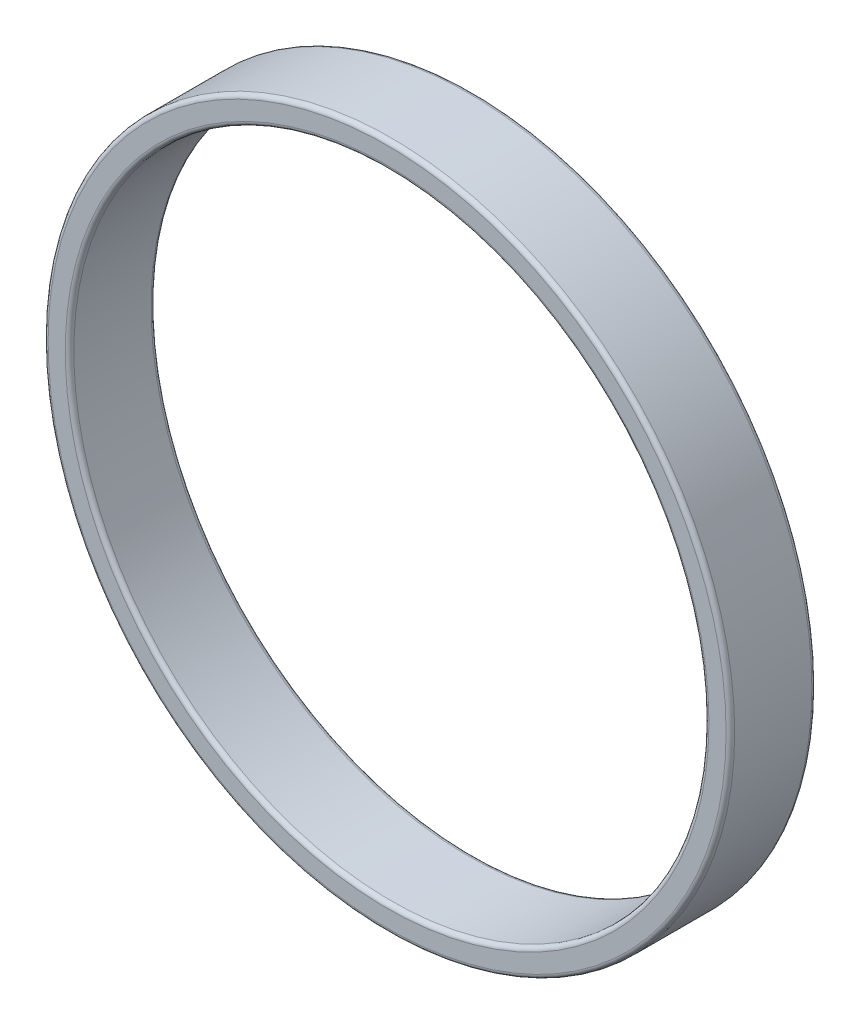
ISO-10303-21;
HEADER;
FILE_DESCRIPTION(('STEP AP214'),'2;1');
FILE_NAME('part.step','',(''),(''),'','','');
FILE_SCHEMA(('AUTOMOTIVE_DESIGN { 1 0 10303 214 1 1 1 1 }'));
ENDSEC;
DATA;
#1=APPLICATION_CONTEXT('core data for automotive mechanical design processes');
#2=APPLICATION_PROTOCOL_DEFINITION('international standard','automotive_design',2000,#1);
#3=PRODUCT_CONTEXT('',#1,'mechanical');
#4=PRODUCT('Part','Part','',(#3));
#5=PRODUCT_RELATED_PRODUCT_CATEGORY('part','',(#4));
#6=PRODUCT_DEFINITION_FORMATION('','',#4);
#7=PRODUCT_DEFINITION_CONTEXT('part definition',#1,'design');
#8=PRODUCT_DEFINITION('design','',#6,#7);
#9=PRODUCT_DEFINITION_SHAPE('','',#8);
#10=(LENGTH_UNIT() NAMED_UNIT(*) SI_UNIT(.MILLI.,.METRE.));
#11=(NAMED_UNIT(*) PLANE_ANGLE_UNIT() SI_UNIT($,.RADIAN.));
#12=(NAMED_UNIT(*) SI_UNIT($,.STERADIAN.) SOLID_ANGLE_UNIT());
#13=UNCERTAINTY_MEASURE_WITH_UNIT(LENGTH_MEASURE(1.E-05),#10,'distance_accuracy_value','');
#14=(GEOMETRIC_REPRESENTATION_CONTEXT(3) GLOBAL_UNCERTAINTY_ASSIGNED_CONTEXT((#13)) GLOBAL_UNIT_ASSIGNED_CONTEXT((#10,
#11,#12)) REPRESENTATION_CONTEXT('',''));
#15=CARTESIAN_POINT('',(0.,0.,0.));
#16=DIRECTION('',(0.,0.,1.));
#17=DIRECTION('',(1.,0.,0.));
#18=AXIS2_PLACEMENT_3D('',#15,#16,#17);
#19=CARTESIAN_POINT('',(0.,0.,12.7));
#20=DIRECTION('',(0.,0.,1.));
#21=DIRECTION('',(1.,0.,0.));
#22=AXIS2_PLACEMENT_3D('',#19,#20,#21);
#23=PLANE('',#22);
#24=CARTESIAN_POINT('',(0.,0.,12.7));
#25=DIRECTION('',(0.,0.,1.));
#26=DIRECTION('',(1.,0.,0.));
#27=AXIS2_PLACEMENT_3D('',#24,#25,#26);
#28=CIRCLE('',#27,47.625);
#29=CARTESIAN_POINT('',(47.625,0.,12.7));
#30=VERTEX_POINT('',#29);
#31=EDGE_CURVE('E10',#30,#30,#28,.F.);
#32=ORIENTED_EDGE('',*,*,#31,.T.);
#33=EDGE_LOOP('',(#32));
#34=FACE_BOUND('',#33,.T.);
#35=CARTESIAN_POINT('',(0.,0.,12.7));
#36=DIRECTION('',(0.,0.,1.));
#37=DIRECTION('',(1.,0.,0.));
#38=AXIS2_PLACEMENT_3D('',#35,#36,#37);
#39=CIRCLE('',#38,50.165);
#40=CARTESIAN_POINT('',(50.165,0.,12.7));
#41=VERTEX_POINT('',#40);
#42=EDGE_CURVE('E37',#41,#41,#39,.T.);
#43=ORIENTED_EDGE('',*,*,#42,.T.);
#44=EDGE_LOOP('',(#43));
#45=FACE_BOUND('',#44,.T.);
#46=ADVANCED_FACE('F30',(#34,#45),#23,.T.);
#47=CARTESIAN_POINT('',(0.,0.,0.));
#48=DIRECTION('',(0.,0.,1.));
#49=DIRECTION('',(1.,0.,0.));
#50=AXIS2_PLACEMENT_3D('',#47,#48,#49);
#51=PLANE('',#50);
#52=CARTESIAN_POINT('',(0.,0.,0.));
#53=DIRECTION('',(0.,0.,1.));
#54=DIRECTION('',(1.,0.,0.));
#55=AXIS2_PLACEMENT_3D('',#52,#53,#54);
#56=CIRCLE('',#55,47.625);
#57=CARTESIAN_POINT('',(47.625,0.,0.));
#58=VERTEX_POINT('',#57);
#59=EDGE_CURVE('E56',#58,#58,#56,.T.);
#60=ORIENTED_EDGE('',*,*,#59,.T.);
#61=EDGE_LOOP('',(#60));
#62=FACE_BOUND('',#61,.T.);
#63=CARTESIAN_POINT('',(0.,0.,0.));
#64=DIRECTION('',(0.,0.,1.));
#65=DIRECTION('',(1.,0.,0.));
#66=AXIS2_PLACEMENT_3D('',#63,#64,#65);
#67=CIRCLE('',#66,50.165);
#68=CARTESIAN_POINT('',(50.165,0.,0.));
#69=VERTEX_POINT('',#68);
#70=EDGE_CURVE('E59',#69,#69,#67,.F.);
#71=ORIENTED_EDGE('',*,*,#70,.T.);
#72=EDGE_LOOP('',(#71));
#73=FACE_BOUND('',#72,.T.);
#74=ADVANCED_FACE('F63',(#62,#73),#51,.F.);
#75=CARTESIAN_POINT('',(0.,0.,12.7));
#76=DIRECTION('',(0.,0.,-1.));
#77=DIRECTION('',(-1.,0.,0.));
#78=AXIS2_PLACEMENT_3D('',#75,#76,#77);
#79=CYLINDRICAL_SURFACE('',#78,50.8);
#80=CARTESIAN_POINT('',(0.,0.,0.635));
#81=DIRECTION('',(0.,0.,1.));
#82=DIRECTION('',(1.,0.,0.));
#83=AXIS2_PLACEMENT_3D('',#80,#81,#82);
#84=CIRCLE('',#83,50.8);
#85=CARTESIAN_POINT('',(50.8,0.,0.635));
#86=VERTEX_POINT('',#85);
#87=EDGE_CURVE('E41',#86,#86,#84,.T.);
#88=ORIENTED_EDGE('',*,*,#87,.T.);
#89=EDGE_LOOP('',(#88));
#90=FACE_BOUND('',#89,.T.);
#91=CARTESIAN_POINT('',(0.,0.,12.065));
#92=DIRECTION('',(0.,0.,1.));
#93=DIRECTION('',(1.,0.,0.));
#94=AXIS2_PLACEMENT_3D('',#91,#92,#93);
#95=CIRCLE('',#94,50.8);
#96=CARTESIAN_POINT('',(50.8,0.,12.065));
#97=VERTEX_POINT('',#96);
#98=EDGE_CURVE('E45',#97,#97,#95,.F.);
#99=ORIENTED_EDGE('',*,*,#98,.T.);
#100=EDGE_LOOP('',(#99));
#101=FACE_BOUND('',#100,.T.);
#102=ADVANCED_FACE('F73',(#90,#101),#79,.T.);
#103=CARTESIAN_POINT('',(0.,0.,12.7));
#104=DIRECTION('',(0.,0.,-1.));
#105=DIRECTION('',(-1.,0.,0.));
#106=AXIS2_PLACEMENT_3D('',#103,#104,#105);
#107=CYLINDRICAL_SURFACE('',#106,46.99);
#108=CARTESIAN_POINT('',(0.,0.,0.635));
#109=DIRECTION('',(0.,0.,1.));
#110=DIRECTION('',(1.,0.,0.));
#111=AXIS2_PLACEMENT_3D('',#108,#109,#110);
#112=CIRCLE('',#111,46.99);
#113=CARTESIAN_POINT('',(46.99,0.,0.635));
#114=VERTEX_POINT('',#113);
#115=EDGE_CURVE('E50',#114,#114,#112,.F.);
#116=ORIENTED_EDGE('',*,*,#115,.T.);
#117=EDGE_LOOP('',(#116));
#118=FACE_BOUND('',#117,.T.);
#119=CARTESIAN_POINT('',(0.,0.,12.065));
#120=DIRECTION('',(0.,0.,1.));
#121=DIRECTION('',(1.,0.,0.));
#122=AXIS2_PLACEMENT_3D('',#119,#120,#121);
#123=CIRCLE('',#122,46.99);
#124=CARTESIAN_POINT('',(46.99,0.,12.065));
#125=VERTEX_POINT('',#124);
#126=EDGE_CURVE('E53',#125,#125,#123,.T.);
#127=ORIENTED_EDGE('',*,*,#126,.T.);
#128=EDGE_LOOP('',(#127));
#129=FACE_BOUND('',#128,.T.);
#130=ADVANCED_FACE('F76',(#118,#129),#107,.F.);
#131=CARTESIAN_POINT('',(0.,0.,0.635));
#132=DIRECTION('',(0.,0.,1.));
#133=DIRECTION('',(1.,0.,0.));
#134=AXIS2_PLACEMENT_3D('',#131,#132,#133);
#135=TOROIDAL_SURFACE('',#134,47.625,0.635);
#136=ORIENTED_EDGE('',*,*,#115,.F.);
#137=EDGE_LOOP('',(#136));
#138=FACE_BOUND('',#137,.T.);
#139=ORIENTED_EDGE('',*,*,#59,.F.);
#140=EDGE_LOOP('',(#139));
#141=FACE_BOUND('',#140,.T.);
#142=ADVANCED_FACE('F69',(#138,#141),#135,.T.);
#143=CARTESIAN_POINT('',(0.,0.,0.635));
#144=DIRECTION('',(0.,0.,1.));
#145=DIRECTION('',(1.,0.,0.));
#146=AXIS2_PLACEMENT_3D('',#143,#144,#145);
#147=TOROIDAL_SURFACE('',#146,50.165,0.635);
#148=ORIENTED_EDGE('',*,*,#70,.F.);
#149=EDGE_LOOP('',(#148));
#150=FACE_BOUND('',#149,.T.);
#151=ORIENTED_EDGE('',*,*,#87,.F.);
#152=EDGE_LOOP('',(#151));
#153=FACE_BOUND('',#152,.T.);
#154=ADVANCED_FACE('F65',(#150,#153),#147,.T.);
#155=CARTESIAN_POINT('',(0.,0.,12.065));
#156=DIRECTION('',(0.,0.,1.));
#157=DIRECTION('',(1.,0.,0.));
#158=AXIS2_PLACEMENT_3D('',#155,#156,#157);
#159=TOROIDAL_SURFACE('',#158,47.625,0.635);
#160=ORIENTED_EDGE('',*,*,#31,.F.);
#161=EDGE_LOOP('',(#160));
#162=FACE_BOUND('',#161,.T.);
#163=ORIENTED_EDGE('',*,*,#126,.F.);
#164=EDGE_LOOP('',(#163));
#165=FACE_BOUND('',#164,.T.);
#166=ADVANCED_FACE('F68',(#162,#165),#159,.T.);
#167=CARTESIAN_POINT('',(0.,0.,12.065));
#168=DIRECTION('',(0.,0.,1.));
#169=DIRECTION('',(1.,0.,0.));
#170=AXIS2_PLACEMENT_3D('',#167,#168,#169);
#171=TOROIDAL_SURFACE('',#170,50.165,0.635);
#172=ORIENTED_EDGE('',*,*,#98,.F.);
#173=EDGE_LOOP('',(#172));
#174=FACE_BOUND('',#173,.T.);
#175=ORIENTED_EDGE('',*,*,#42,.F.);
#176=EDGE_LOOP('',(#175));
#177=FACE_BOUND('',#176,.T.);
#178=ADVANCED_FACE('F32',(#174,#177),#171,.T.);
#179=CLOSED_SHELL('',(#46,#74,#102,#130,#142,#154,#166,#178));
#180=MANIFOLD_SOLID_BREP('B2',#179);
#181=ADVANCED_BREP_SHAPE_REPRESENTATION('',(#18,#180),#14);
#182=SHAPE_DEFINITION_REPRESENTATION(#9,#181);
ENDSEC;
END-ISO-10303-21;
